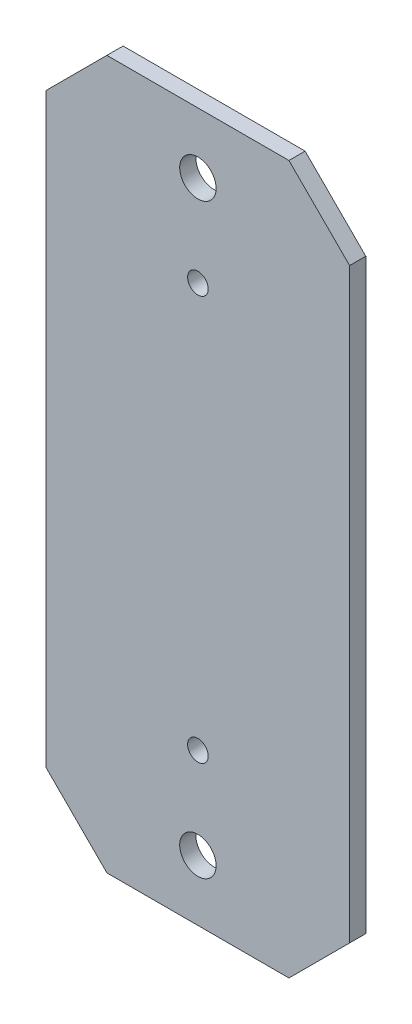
ISO-10303-21;
HEADER;
FILE_DESCRIPTION(('STEP AP214'),'2;1');
FILE_NAME('part.step','',(''),(''),'','','');
FILE_SCHEMA(('AUTOMOTIVE_DESIGN { 1 0 10303 214 1 1 1 1 }'));
ENDSEC;
DATA;
#1=APPLICATION_CONTEXT('core data for automotive mechanical design processes');
#2=APPLICATION_PROTOCOL_DEFINITION('international standard','automotive_design',2000,#1);
#3=PRODUCT_CONTEXT('',#1,'mechanical');
#4=PRODUCT('Part','Part','',(#3));
#5=PRODUCT_RELATED_PRODUCT_CATEGORY('part','',(#4));
#6=PRODUCT_DEFINITION_FORMATION('','',#4);
#7=PRODUCT_DEFINITION_CONTEXT('part definition',#1,'design');
#8=PRODUCT_DEFINITION('design','',#6,#7);
#9=PRODUCT_DEFINITION_SHAPE('','',#8);
#10=(LENGTH_UNIT() NAMED_UNIT(*) SI_UNIT(.MILLI.,.METRE.));
#11=(NAMED_UNIT(*) PLANE_ANGLE_UNIT() SI_UNIT($,.RADIAN.));
#12=(NAMED_UNIT(*) SI_UNIT($,.STERADIAN.) SOLID_ANGLE_UNIT());
#13=UNCERTAINTY_MEASURE_WITH_UNIT(LENGTH_MEASURE(1.E-05),#10,'distance_accuracy_value','');
#14=(GEOMETRIC_REPRESENTATION_CONTEXT(3) GLOBAL_UNCERTAINTY_ASSIGNED_CONTEXT((#13)) GLOBAL_UNIT_ASSIGNED_CONTEXT((#10,
#11,#12)) REPRESENTATION_CONTEXT('',''));
#15=CARTESIAN_POINT('',(0.,0.,0.));
#16=DIRECTION('',(0.,0.,1.));
#17=DIRECTION('',(1.,0.,0.));
#18=AXIS2_PLACEMENT_3D('',#15,#16,#17);
#19=CARTESIAN_POINT('',(-75.0000000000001,-296.325485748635,8.));
#20=DIRECTION('',(1.,0.,0.));
#21=DIRECTION('',(0.,1.,0.));
#22=AXIS2_PLACEMENT_3D('',#19,#20,#21);
#23=PLANE('',#22);
#24=DIRECTION('',(0.,-1.,0.));
#25=VECTOR('',#24,1.);
#26=CARTESIAN_POINT('',(-75.0000000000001,-296.325485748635,8.));
#27=LINE('',#26,#25);
#28=CARTESIAN_POINT('',(-75.0000000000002,145.,8.));
#29=VERTEX_POINT('',#28);
#30=CARTESIAN_POINT('',(-75.0000000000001,-145.,8.));
#31=VERTEX_POINT('',#30);
#32=EDGE_CURVE('E141',#29,#31,#27,.T.);
#33=ORIENTED_EDGE('',*,*,#32,.F.);
#34=DIRECTION('',(0.,0.,-1.));
#35=VECTOR('',#34,1.);
#36=CARTESIAN_POINT('',(-75.0000000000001,145.,8.));
#37=LINE('',#36,#35);
#38=CARTESIAN_POINT('',(-75.0000000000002,145.,0.));
#39=VERTEX_POINT('',#38);
#40=EDGE_CURVE('E160',#29,#39,#37,.T.);
#41=ORIENTED_EDGE('',*,*,#40,.T.);
#42=DIRECTION('',(0.,-1.,0.));
#43=VECTOR('',#42,1.);
#44=CARTESIAN_POINT('',(-75.0000000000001,-296.325485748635,0.));
#45=LINE('',#44,#43);
#46=CARTESIAN_POINT('',(-75.0000000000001,-145.,0.));
#47=VERTEX_POINT('',#46);
#48=EDGE_CURVE('E166',#39,#47,#45,.T.);
#49=ORIENTED_EDGE('',*,*,#48,.T.);
#50=DIRECTION('',(0.,0.,1.));
#51=VECTOR('',#50,1.);
#52=CARTESIAN_POINT('',(-75.0000000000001,-145.,8.));
#53=LINE('',#52,#51);
#54=EDGE_CURVE('E158',#47,#31,#53,.T.);
#55=ORIENTED_EDGE('',*,*,#54,.T.);
#56=EDGE_LOOP('',(#33,#41,#49,#55));
#57=FACE_BOUND('',#56,.T.);
#58=ADVANCED_FACE('F36',(#57),#23,.F.);
#59=CARTESIAN_POINT('',(0.,-175.,8.));
#60=DIRECTION('',(0.,-1.,0.));
#61=DIRECTION('',(1.,0.,0.));
#62=AXIS2_PLACEMENT_3D('',#59,#60,#61);
#63=PLANE('',#62);
#64=DIRECTION('',(-1.,0.,0.));
#65=VECTOR('',#64,1.);
#66=CARTESIAN_POINT('',(0.,-175.,8.));
#67=LINE('',#66,#65);
#68=CARTESIAN_POINT('',(45.,-175.,8.));
#69=VERTEX_POINT('',#68);
#70=CARTESIAN_POINT('',(-45.0000000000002,-175.,8.));
#71=VERTEX_POINT('',#70);
#72=EDGE_CURVE('E186',#69,#71,#67,.T.);
#73=ORIENTED_EDGE('',*,*,#72,.T.);
#74=DIRECTION('',(0.,0.,-1.));
#75=VECTOR('',#74,1.);
#76=CARTESIAN_POINT('',(-45.0000000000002,-175.,0.));
#77=LINE('',#76,#75);
#78=CARTESIAN_POINT('',(-45.0000000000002,-175.,0.));
#79=VERTEX_POINT('',#78);
#80=EDGE_CURVE('E11',#71,#79,#77,.T.);
#81=ORIENTED_EDGE('',*,*,#80,.T.);
#82=DIRECTION('',(-1.,0.,0.));
#83=VECTOR('',#82,1.);
#84=CARTESIAN_POINT('',(0.,-175.,0.));
#85=LINE('',#84,#83);
#86=CARTESIAN_POINT('',(45.,-175.,0.));
#87=VERTEX_POINT('',#86);
#88=EDGE_CURVE('E135',#87,#79,#85,.T.);
#89=ORIENTED_EDGE('',*,*,#88,.F.);
#90=DIRECTION('',(0.,0.,1.));
#91=VECTOR('',#90,1.);
#92=CARTESIAN_POINT('',(45.,-175.,8.));
#93=LINE('',#92,#91);
#94=EDGE_CURVE('E44',#87,#69,#93,.T.);
#95=ORIENTED_EDGE('',*,*,#94,.T.);
#96=EDGE_LOOP('',(#73,#81,#89,#95));
#97=FACE_BOUND('',#96,.T.);
#98=ADVANCED_FACE('F220',(#97),#63,.T.);
#99=CARTESIAN_POINT('',(75.0000000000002,-296.325485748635,8.));
#100=DIRECTION('',(1.,0.,0.));
#101=DIRECTION('',(0.,1.,0.));
#102=AXIS2_PLACEMENT_3D('',#99,#100,#101);
#103=PLANE('',#102);
#104=DIRECTION('',(0.,-1.,0.));
#105=VECTOR('',#104,1.);
#106=CARTESIAN_POINT('',(75.0000000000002,-296.325485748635,0.));
#107=LINE('',#106,#105);
#108=CARTESIAN_POINT('',(75.0000000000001,145.,0.));
#109=VERTEX_POINT('',#108);
#110=CARTESIAN_POINT('',(75.0000000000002,-145.,0.));
#111=VERTEX_POINT('',#110);
#112=EDGE_CURVE('E130',#109,#111,#107,.T.);
#113=ORIENTED_EDGE('',*,*,#112,.F.);
#114=DIRECTION('',(0.,0.,1.));
#115=VECTOR('',#114,1.);
#116=CARTESIAN_POINT('',(75.0000000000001,145.,8.));
#117=LINE('',#116,#115);
#118=CARTESIAN_POINT('',(75.0000000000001,145.,8.));
#119=VERTEX_POINT('',#118);
#120=EDGE_CURVE('E107',#109,#119,#117,.T.);
#121=ORIENTED_EDGE('',*,*,#120,.T.);
#122=DIRECTION('',(0.,-1.,0.));
#123=VECTOR('',#122,1.);
#124=CARTESIAN_POINT('',(75.0000000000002,-296.325485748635,8.));
#125=LINE('',#124,#123);
#126=CARTESIAN_POINT('',(75.0000000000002,-145.,8.));
#127=VERTEX_POINT('',#126);
#128=EDGE_CURVE('E183',#119,#127,#125,.T.);
#129=ORIENTED_EDGE('',*,*,#128,.T.);
#130=DIRECTION('',(0.,0.,-1.));
#131=VECTOR('',#130,1.);
#132=CARTESIAN_POINT('',(75.0000000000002,-145.,8.));
#133=LINE('',#132,#131);
#134=EDGE_CURVE('E112',#127,#111,#133,.T.);
#135=ORIENTED_EDGE('',*,*,#134,.T.);
#136=EDGE_LOOP('',(#113,#121,#129,#135));
#137=FACE_BOUND('',#136,.T.);
#138=ADVANCED_FACE('F225',(#137),#103,.T.);
#139=CARTESIAN_POINT('',(0.,145.,8.));
#140=DIRECTION('',(0.,0.,-1.));
#141=DIRECTION('',(-1.,0.,0.));
#142=AXIS2_PLACEMENT_3D('',#139,#140,#141);
#143=CYLINDRICAL_SURFACE('',#142,9.00000000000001);
#144=CARTESIAN_POINT('',(0.,145.,8.));
#145=DIRECTION('',(0.,0.,1.));
#146=DIRECTION('',(1.,0.,0.));
#147=AXIS2_PLACEMENT_3D('',#144,#145,#146);
#148=CIRCLE('',#147,9.00000000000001);
#149=CARTESIAN_POINT('',(9.00000000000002,145.,8.));
#150=VERTEX_POINT('',#149);
#151=EDGE_CURVE('E179',#150,#150,#148,.F.);
#152=ORIENTED_EDGE('',*,*,#151,.F.);
#153=EDGE_LOOP('',(#152));
#154=FACE_BOUND('',#153,.T.);
#155=CARTESIAN_POINT('',(0.,145.,0.));
#156=DIRECTION('',(0.,0.,1.));
#157=DIRECTION('',(1.,0.,0.));
#158=AXIS2_PLACEMENT_3D('',#155,#156,#157);
#159=CIRCLE('',#158,9.00000000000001);
#160=CARTESIAN_POINT('',(9.00000000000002,145.,0.));
#161=VERTEX_POINT('',#160);
#162=EDGE_CURVE('E129',#161,#161,#159,.F.);
#163=ORIENTED_EDGE('',*,*,#162,.T.);
#164=EDGE_LOOP('',(#163));
#165=FACE_BOUND('',#164,.T.);
#166=ADVANCED_FACE('F258',(#154,#165),#143,.F.);
#167=CARTESIAN_POINT('',(0.,175.,8.));
#168=DIRECTION('',(0.,-1.,0.));
#169=DIRECTION('',(1.,0.,0.));
#170=AXIS2_PLACEMENT_3D('',#167,#168,#169);
#171=PLANE('',#170);
#172=DIRECTION('',(-1.,0.,0.));
#173=VECTOR('',#172,1.);
#174=CARTESIAN_POINT('',(0.,175.,8.));
#175=LINE('',#174,#173);
#176=CARTESIAN_POINT('',(45.0000000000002,175.,8.));
#177=VERTEX_POINT('',#176);
#178=CARTESIAN_POINT('',(-45.,175.,8.));
#179=VERTEX_POINT('',#178);
#180=EDGE_CURVE('E122',#177,#179,#175,.T.);
#181=ORIENTED_EDGE('',*,*,#180,.F.);
#182=DIRECTION('',(0.,0.,-1.));
#183=VECTOR('',#182,1.);
#184=CARTESIAN_POINT('',(45.0000000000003,175.,0.));
#185=LINE('',#184,#183);
#186=CARTESIAN_POINT('',(45.0000000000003,175.,0.));
#187=VERTEX_POINT('',#186);
#188=EDGE_CURVE('E106',#177,#187,#185,.T.);
#189=ORIENTED_EDGE('',*,*,#188,.T.);
#190=DIRECTION('',(-1.,0.,0.));
#191=VECTOR('',#190,1.);
#192=CARTESIAN_POINT('',(0.,175.,0.));
#193=LINE('',#192,#191);
#194=CARTESIAN_POINT('',(-45.,175.,0.));
#195=VERTEX_POINT('',#194);
#196=EDGE_CURVE('E119',#187,#195,#193,.T.);
#197=ORIENTED_EDGE('',*,*,#196,.T.);
#198=DIRECTION('',(0.,0.,1.));
#199=VECTOR('',#198,1.);
#200=CARTESIAN_POINT('',(-45.,175.,8.));
#201=LINE('',#200,#199);
#202=EDGE_CURVE('E124',#195,#179,#201,.T.);
#203=ORIENTED_EDGE('',*,*,#202,.T.);
#204=EDGE_LOOP('',(#181,#189,#197,#203));
#205=FACE_BOUND('',#204,.T.);
#206=ADVANCED_FACE('F118',(#205),#171,.F.);
#207=CARTESIAN_POINT('',(0.,-145.,8.));
#208=DIRECTION('',(0.,0.,-1.));
#209=DIRECTION('',(-1.,0.,0.));
#210=AXIS2_PLACEMENT_3D('',#207,#208,#209);
#211=CYLINDRICAL_SURFACE('',#210,8.99999999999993);
#212=CARTESIAN_POINT('',(0.,-145.,8.));
#213=DIRECTION('',(0.,0.,1.));
#214=DIRECTION('',(1.,0.,0.));
#215=AXIS2_PLACEMENT_3D('',#212,#213,#214);
#216=CIRCLE('',#215,8.99999999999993);
#217=CARTESIAN_POINT('',(8.99999999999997,-145.,8.));
#218=VERTEX_POINT('',#217);
#219=EDGE_CURVE('E142',#218,#218,#216,.T.);
#220=ORIENTED_EDGE('',*,*,#219,.T.);
#221=EDGE_LOOP('',(#220));
#222=FACE_BOUND('',#221,.T.);
#223=CARTESIAN_POINT('',(0.,-145.,0.));
#224=DIRECTION('',(0.,0.,1.));
#225=DIRECTION('',(1.,0.,0.));
#226=AXIS2_PLACEMENT_3D('',#223,#224,#225);
#227=CIRCLE('',#226,8.99999999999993);
#228=CARTESIAN_POINT('',(8.99999999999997,-145.,0.));
#229=VERTEX_POINT('',#228);
#230=EDGE_CURVE('E133',#229,#229,#227,.T.);
#231=ORIENTED_EDGE('',*,*,#230,.F.);
#232=EDGE_LOOP('',(#231));
#233=FACE_BOUND('',#232,.T.);
#234=ADVANCED_FACE('F244',(#222,#233),#211,.F.);
#235=CARTESIAN_POINT('',(0.,-296.325485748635,8.));
#236=DIRECTION('',(0.,0.,1.));
#237=DIRECTION('',(1.,0.,0.));
#238=AXIS2_PLACEMENT_3D('',#235,#236,#237);
#239=PLANE('',#238);
#240=CARTESIAN_POINT('',(0.,-100.,8.));
#241=DIRECTION('',(0.,0.,1.));
#242=DIRECTION('',(1.,0.,0.));
#243=AXIS2_PLACEMENT_3D('',#240,#241,#242);
#244=CIRCLE('',#243,5.09999999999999);
#245=CARTESIAN_POINT('',(5.10000000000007,-100.,8.));
#246=VERTEX_POINT('',#245);
#247=EDGE_CURVE('E191',#246,#246,#244,.T.);
#248=ORIENTED_EDGE('',*,*,#247,.F.);
#249=EDGE_LOOP('',(#248));
#250=FACE_BOUND('',#249,.T.);
#251=CARTESIAN_POINT('',(0.,100.,8.));
#252=DIRECTION('',(0.,0.,1.));
#253=DIRECTION('',(1.,0.,0.));
#254=AXIS2_PLACEMENT_3D('',#251,#252,#253);
#255=CIRCLE('',#254,5.09999999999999);
#256=CARTESIAN_POINT('',(5.10000000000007,100.,8.));
#257=VERTEX_POINT('',#256);
#258=EDGE_CURVE('E171',#257,#257,#255,.T.);
#259=ORIENTED_EDGE('',*,*,#258,.F.);
#260=EDGE_LOOP('',(#259));
#261=FACE_BOUND('',#260,.T.);
#262=ORIENTED_EDGE('',*,*,#128,.F.);
#263=DIRECTION('',(-0.707106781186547,0.707106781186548,0.));
#264=VECTOR('',#263,1.);
#265=CARTESIAN_POINT('',(258.162742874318,-38.1627428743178,8.));
#266=LINE('',#265,#264);
#267=EDGE_CURVE('E156',#119,#177,#266,.T.);
#268=ORIENTED_EDGE('',*,*,#267,.T.);
#269=ORIENTED_EDGE('',*,*,#180,.T.);
#270=DIRECTION('',(0.707106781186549,0.707106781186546,0.));
#271=VECTOR('',#270,1.);
#272=CARTESIAN_POINT('',(-258.162742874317,-38.1627428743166,8.));
#273=LINE('',#272,#271);
#274=EDGE_CURVE('E154',#179,#29,#273,.F.);
#275=ORIENTED_EDGE('',*,*,#274,.T.);
#276=ORIENTED_EDGE('',*,*,#32,.T.);
#277=DIRECTION('',(0.707106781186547,-0.707106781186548,0.));
#278=VECTOR('',#277,1.);
#279=CARTESIAN_POINT('',(38.1627428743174,-258.162742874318,8.));
#280=LINE('',#279,#278);
#281=EDGE_CURVE('E51',#31,#71,#280,.T.);
#282=ORIENTED_EDGE('',*,*,#281,.T.);
#283=ORIENTED_EDGE('',*,*,#72,.F.);
#284=DIRECTION('',(-0.707106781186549,-0.707106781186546,0.));
#285=VECTOR('',#284,1.);
#286=CARTESIAN_POINT('',(-38.1627428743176,-258.162742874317,8.));
#287=LINE('',#286,#285);
#288=EDGE_CURVE('E151',#69,#127,#287,.F.);
#289=ORIENTED_EDGE('',*,*,#288,.T.);
#290=EDGE_LOOP('',(#262,#268,#269,#275,#276,#282,#283,#289));
#291=FACE_BOUND('',#290,.T.);
#292=ORIENTED_EDGE('',*,*,#151,.T.);
#293=EDGE_LOOP('',(#292));
#294=FACE_BOUND('',#293,.T.);
#295=ORIENTED_EDGE('',*,*,#219,.F.);
#296=EDGE_LOOP('',(#295));
#297=FACE_BOUND('',#296,.T.);
#298=ADVANCED_FACE('F202',(#250,#261,#291,#294,#297),#239,.T.);
#299=CARTESIAN_POINT('',(0.,-296.325485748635,0.));
#300=DIRECTION('',(0.,0.,1.));
#301=DIRECTION('',(1.,0.,0.));
#302=AXIS2_PLACEMENT_3D('',#299,#300,#301);
#303=PLANE('',#302);
#304=CARTESIAN_POINT('',(0.,-100.,0.));
#305=DIRECTION('',(0.,0.,-1.));
#306=DIRECTION('',(-1.,0.,0.));
#307=AXIS2_PLACEMENT_3D('',#304,#305,#306);
#308=CIRCLE('',#307,5.1);
#309=CARTESIAN_POINT('',(-5.09999999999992,-100.,0.));
#310=VERTEX_POINT('',#309);
#311=EDGE_CURVE('E194',#310,#310,#308,.T.);
#312=ORIENTED_EDGE('',*,*,#311,.F.);
#313=EDGE_LOOP('',(#312));
#314=FACE_BOUND('',#313,.T.);
#315=CARTESIAN_POINT('',(0.,100.,0.));
#316=DIRECTION('',(0.,0.,-1.));
#317=DIRECTION('',(-1.,0.,0.));
#318=AXIS2_PLACEMENT_3D('',#315,#316,#317);
#319=CIRCLE('',#318,5.1);
#320=CARTESIAN_POINT('',(-5.09999999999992,100.,0.));
#321=VERTEX_POINT('',#320);
#322=EDGE_CURVE('E174',#321,#321,#319,.T.);
#323=ORIENTED_EDGE('',*,*,#322,.F.);
#324=EDGE_LOOP('',(#323));
#325=FACE_BOUND('',#324,.T.);
#326=ORIENTED_EDGE('',*,*,#196,.F.);
#327=DIRECTION('',(0.707106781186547,-0.707106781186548,0.));
#328=VECTOR('',#327,1.);
#329=CARTESIAN_POINT('',(45.0000000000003,175.,0.));
#330=LINE('',#329,#328);
#331=EDGE_CURVE('E102',#187,#109,#330,.T.);
#332=ORIENTED_EDGE('',*,*,#331,.T.);
#333=ORIENTED_EDGE('',*,*,#112,.T.);
#334=DIRECTION('',(0.707106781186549,0.707106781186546,0.));
#335=VECTOR('',#334,1.);
#336=CARTESIAN_POINT('',(75.0000000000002,-145.,0.));
#337=LINE('',#336,#335);
#338=EDGE_CURVE('E123',#111,#87,#337,.F.);
#339=ORIENTED_EDGE('',*,*,#338,.T.);
#340=ORIENTED_EDGE('',*,*,#88,.T.);
#341=DIRECTION('',(-0.707106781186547,0.707106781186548,0.));
#342=VECTOR('',#341,1.);
#343=CARTESIAN_POINT('',(-45.0000000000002,-175.,0.));
#344=LINE('',#343,#342);
#345=EDGE_CURVE('E145',#79,#47,#344,.T.);
#346=ORIENTED_EDGE('',*,*,#345,.T.);
#347=ORIENTED_EDGE('',*,*,#48,.F.);
#348=DIRECTION('',(-0.707106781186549,-0.707106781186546,0.));
#349=VECTOR('',#348,1.);
#350=CARTESIAN_POINT('',(-75.0000000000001,145.,0.));
#351=LINE('',#350,#349);
#352=EDGE_CURVE('E113',#39,#195,#351,.F.);
#353=ORIENTED_EDGE('',*,*,#352,.T.);
#354=EDGE_LOOP('',(#326,#332,#333,#339,#340,#346,#347,#353));
#355=FACE_BOUND('',#354,.T.);
#356=ORIENTED_EDGE('',*,*,#162,.F.);
#357=EDGE_LOOP('',(#356));
#358=FACE_BOUND('',#357,.T.);
#359=ORIENTED_EDGE('',*,*,#230,.T.);
#360=EDGE_LOOP('',(#359));
#361=FACE_BOUND('',#360,.T.);
#362=ADVANCED_FACE('F126',(#314,#325,#355,#358,#361),#303,.F.);
#363=CARTESIAN_POINT('',(45.0000000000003,175.,8.));
#364=DIRECTION('',(0.707106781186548,0.707106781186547,0.));
#365=DIRECTION('',(-0.707106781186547,0.707106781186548,0.));
#366=AXIS2_PLACEMENT_3D('',#363,#364,#365);
#367=PLANE('',#366);
#368=ORIENTED_EDGE('',*,*,#267,.F.);
#369=ORIENTED_EDGE('',*,*,#120,.F.);
#370=ORIENTED_EDGE('',*,*,#331,.F.);
#371=ORIENTED_EDGE('',*,*,#188,.F.);
#372=EDGE_LOOP('',(#368,#369,#370,#371));
#373=FACE_BOUND('',#372,.T.);
#374=ADVANCED_FACE('F105',(#373),#367,.T.);
#375=CARTESIAN_POINT('',(-75.0000000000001,145.,8.));
#376=DIRECTION('',(0.707106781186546,-0.707106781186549,0.));
#377=DIRECTION('',(0.707106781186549,0.707106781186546,0.));
#378=AXIS2_PLACEMENT_3D('',#375,#376,#377);
#379=PLANE('',#378);
#380=ORIENTED_EDGE('',*,*,#274,.F.);
#381=ORIENTED_EDGE('',*,*,#202,.F.);
#382=ORIENTED_EDGE('',*,*,#352,.F.);
#383=ORIENTED_EDGE('',*,*,#40,.F.);
#384=EDGE_LOOP('',(#380,#381,#382,#383));
#385=FACE_BOUND('',#384,.T.);
#386=ADVANCED_FACE('F231',(#385),#379,.F.);
#387=CARTESIAN_POINT('',(-45.0000000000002,-175.,8.));
#388=DIRECTION('',(-0.707106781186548,-0.707106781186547,0.));
#389=DIRECTION('',(0.707106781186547,-0.707106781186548,0.));
#390=AXIS2_PLACEMENT_3D('',#387,#388,#389);
#391=PLANE('',#390);
#392=ORIENTED_EDGE('',*,*,#281,.F.);
#393=ORIENTED_EDGE('',*,*,#54,.F.);
#394=ORIENTED_EDGE('',*,*,#345,.F.);
#395=ORIENTED_EDGE('',*,*,#80,.F.);
#396=EDGE_LOOP('',(#392,#393,#394,#395));
#397=FACE_BOUND('',#396,.T.);
#398=ADVANCED_FACE('F216',(#397),#391,.T.);
#399=CARTESIAN_POINT('',(75.0000000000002,-145.,8.));
#400=DIRECTION('',(-0.707106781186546,0.707106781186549,0.));
#401=DIRECTION('',(-0.707106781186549,-0.707106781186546,0.));
#402=AXIS2_PLACEMENT_3D('',#399,#400,#401);
#403=PLANE('',#402);
#404=ORIENTED_EDGE('',*,*,#288,.F.);
#405=ORIENTED_EDGE('',*,*,#94,.F.);
#406=ORIENTED_EDGE('',*,*,#338,.F.);
#407=ORIENTED_EDGE('',*,*,#134,.F.);
#408=EDGE_LOOP('',(#404,#405,#406,#407));
#409=FACE_BOUND('',#408,.T.);
#410=ADVANCED_FACE('F38',(#409),#403,.F.);
#411=CARTESIAN_POINT('',(0.,100.,0.));
#412=DIRECTION('',(0.,0.,-1.));
#413=DIRECTION('',(-1.,0.,0.));
#414=AXIS2_PLACEMENT_3D('',#411,#412,#413);
#415=CYLINDRICAL_SURFACE('',#414,5.09999999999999);
#416=ORIENTED_EDGE('',*,*,#258,.T.);
#417=EDGE_LOOP('',(#416));
#418=FACE_BOUND('',#417,.T.);
#419=ORIENTED_EDGE('',*,*,#322,.T.);
#420=EDGE_LOOP('',(#419));
#421=FACE_BOUND('',#420,.T.);
#422=ADVANCED_FACE('F206',(#418,#421),#415,.F.);
#423=CARTESIAN_POINT('',(0.,-100.,0.));
#424=DIRECTION('',(0.,0.,-1.));
#425=DIRECTION('',(-1.,0.,0.));
#426=AXIS2_PLACEMENT_3D('',#423,#424,#425);
#427=CYLINDRICAL_SURFACE('',#426,5.09999999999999);
#428=ORIENTED_EDGE('',*,*,#247,.T.);
#429=EDGE_LOOP('',(#428));
#430=FACE_BOUND('',#429,.T.);
#431=ORIENTED_EDGE('',*,*,#311,.T.);
#432=EDGE_LOOP('',(#431));
#433=FACE_BOUND('',#432,.T.);
#434=ADVANCED_FACE('F198',(#430,#433),#427,.F.);
#435=CLOSED_SHELL('',(#58,#98,#138,#166,#206,#234,#298,#362,#374,#386,#398,#410,#422,#434));
#436=MANIFOLD_SOLID_BREP('B2',#435);
#437=ADVANCED_BREP_SHAPE_REPRESENTATION('',(#18,#436),#14);
#438=SHAPE_DEFINITION_REPRESENTATION(#9,#437);
ENDSEC;
END-ISO-10303-21;
